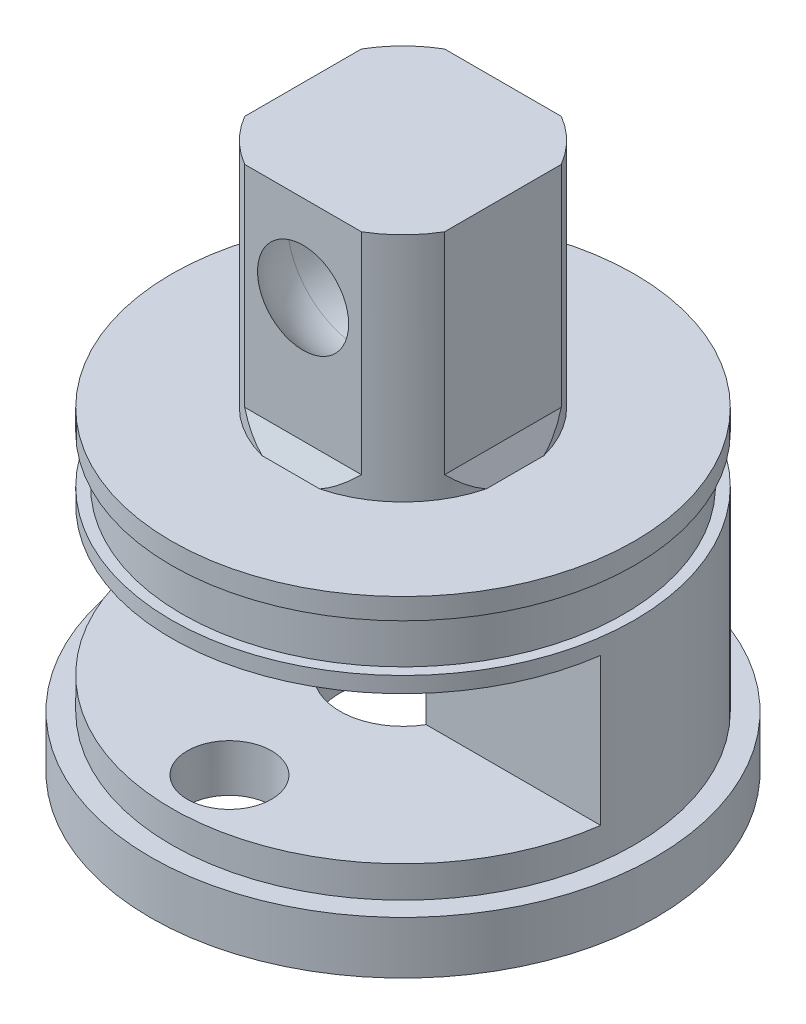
from build123d import *

# Parameters (mm, degrees)
ESQUISSE2_W             = 30.565717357
ESQUISSE2_H             = 7
ENL_V_MAT_EXTRU_3_DEPTH = 10
ESQUISSE3_R             = 2
ENL_V_MAT_EXTRU_5_DEPTH = 11
ESQUISSE4_W             = 13.5
ESQUISSE4_H             = 13.5
ESQUISSE4_W_2           = 9.5
ESQUISSE4_H_2           = 9.5
ENL_V_MAT_EXTRU_6_DEPTH = 10
ESQUISSE5_W             = 13.5
ESQUISSE5_H             = 13.5
ESQUISSE5_W_2           = 9.5
ESQUISSE5_H_2           = 9.5
ENL_V_MAT_EXTRU_7_DEPTH = 1
ENL_V_MAT_EXTRU_7_DRAFT = -30
ESQUISSE6_R             = 2
ENL_V_MAT_EXTRU_8_DEPTH = 8.5
ESQUISSE9_R             = 3.5
ENL_V_MAT_EXTRU_9_DEPTH = 3


with BuildPart() as part:
    # Esquisse1 → Base-R_volution (revolve)
    with BuildSketch(Plane.XY, mode=Mode.PRIVATE) as base_r_volution_sk:
        Polygon((3, 0), (10.5, 0), (10.5, -1.75), (12, -1.75), (12, 0.75), (11, 0.75), (11, 10), (10.5, 10), (10.5, 12.25), (11, 12.25), (11, 13.25), (5.5, 13.25), (5.5, 24.25), (0, 24.25), (0, 13), (3, 13), align=None)
    revolve(base_r_volution_sk.sketch.rotate(Axis((0, 0, 0), (0, 1, 0)), 90), axis=Axis((0, 0, 0), (0, 1, 0)))

    # Esquisse2 → Enl_v. mat.-Extru.3 (cut)
    with BuildSketch(Plane.XY.offset(1.5)):
        with Locations((1.046742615, 5.75)):
            Rectangle(ESQUISSE2_W, ESQUISSE2_H)
    extrude(amount=ENL_V_MAT_EXTRU_3_DEPTH, mode=Mode.SUBTRACT)

    # Esquisse3 → Enl_v. mat.-Extru.5 (cut)
    with BuildSketch(Plane.XZ):
        with Locations(Location((0, 8.25, 0), (0, 0, 270))):
            Circle(ESQUISSE3_R)
    extrude(amount=-ENL_V_MAT_EXTRU_5_DEPTH, mode=Mode.SUBTRACT)

    # Esquisse4 → Enl_v. mat.-Extru.6 (cut)
    with BuildSketch(Plane(origin=(0, 24.25, 0), x_dir=(-1, 0, 0), z_dir=(0, 1, 0))):
        Rectangle(ESQUISSE4_W, ESQUISSE4_H)
        Rectangle(ESQUISSE4_W_2, ESQUISSE4_H_2, mode=Mode.SUBTRACT)
    extrude(amount=-ENL_V_MAT_EXTRU_6_DEPTH, mode=Mode.SUBTRACT)


with BuildPart() as enl_v_mat_extru_7_tool:
    # Esquisse5 → Enl_v. mat.-Extru.7 (with draft: the straight prism first)
    with BuildSketch(Plane(origin=(0, 14.25, 0), x_dir=(-1, 0, 0), z_dir=(0, 1, 0))):
        Rectangle(ESQUISSE5_W, ESQUISSE5_H)
        Rectangle(ESQUISSE5_W_2, ESQUISSE5_H_2, mode=Mode.SUBTRACT)
    extrude(amount=-ENL_V_MAT_EXTRU_7_DEPTH)
    # Enl_v. mat.-Extru.7: the draft: its side faces are tilted about the plane it starts from
    enl_v_mat_extru_7_sides = [enl_v_mat_extru_7_tool.faces().sort_by_distance(p)[0] for p in [
        (0, 13.75, -6.75),
        (-6.75, 13.75, 0),
        (0, 13.75, 6.75),
        (6.75, 13.75, 0),
        (0, 13.75, 4.75),
        (-4.75, 13.75, 0),
        (0, 13.75, -4.75),
        (4.75, 13.75, 0),
    ]]
    draft(enl_v_mat_extru_7_sides, Plane(origin=(0, 14.25, 0), x_dir=(-1, 0, 0), z_dir=(0, 1, 0)), ENL_V_MAT_EXTRU_7_DRAFT)


with BuildPart() as part_1:
    add(part.part)

    # Enl_v. mat.-Extru.7: cut by enl_v_mat_extru_7_tool
    add(enl_v_mat_extru_7_tool.part, mode=Mode.SUBTRACT)

    # Esquisse6 → Enl_v. mat.-Extru.8 (cut)
    with BuildSketch(Plane.XY.offset(4.75)):
        with Locations((0, 20.147423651)):
            Circle(ESQUISSE6_R)
    extrude(amount=-ENL_V_MAT_EXTRU_8_DEPTH, mode=Mode.SUBTRACT)

    # Esquisse8 → Enl_vement de mati_re-R_volution2 (revolve, cut)
    with BuildSketch(Plane.XY.offset(2)):
        with BuildLine():
            Line((0, 23.647423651), (0, 16.647423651))
            ThreePointArc((0, 16.647423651), (3.5, 20.147423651), (0, 23.647423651))
        make_face()
    revolve(axis=Axis((0, 23.600155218, 2), (0, -1, 0)), mode=Mode.SUBTRACT)

    # Esquisse9 → Enl_v. mat.-Extru.9 (cut)
    with BuildSketch(Plane.XY.offset(2)):
        with Locations((0, 20.147423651)):
            Circle(ESQUISSE9_R)
    extrude(amount=-ENL_V_MAT_EXTRU_9_DEPTH, mode=Mode.SUBTRACT)


solid = part_1.part
